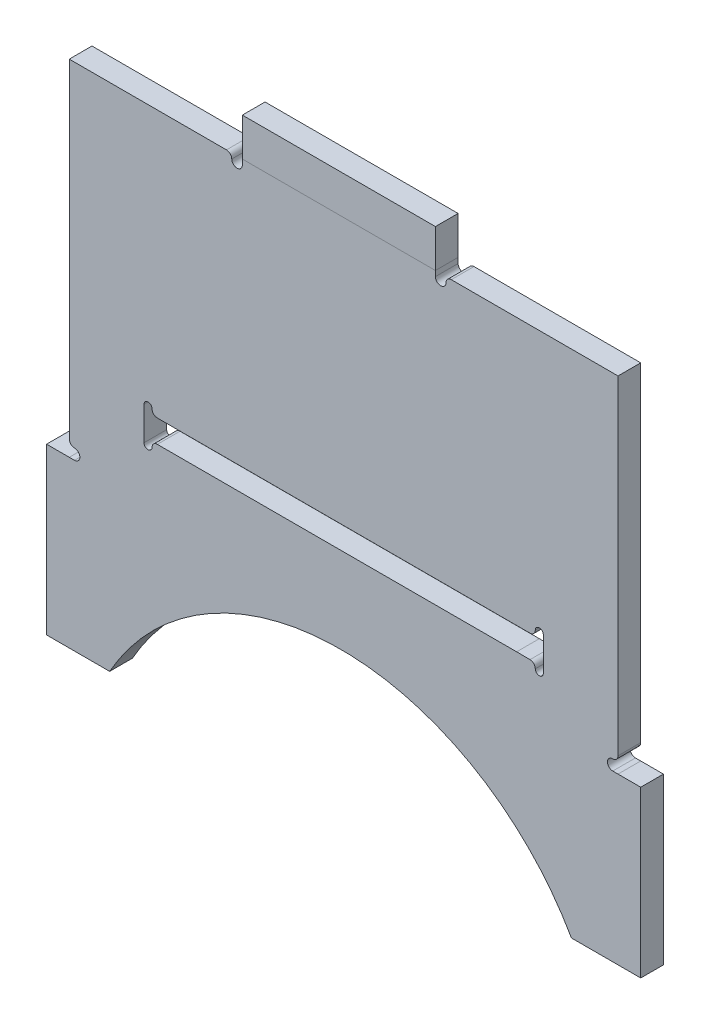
ISO-10303-21;
HEADER;
FILE_DESCRIPTION(('STEP AP214'),'2;1');
FILE_NAME('part.step','',(''),(''),'','','');
FILE_SCHEMA(('AUTOMOTIVE_DESIGN { 1 0 10303 214 1 1 1 1 }'));
ENDSEC;
DATA;
#1=APPLICATION_CONTEXT('core data for automotive mechanical design processes');
#2=APPLICATION_PROTOCOL_DEFINITION('international standard','automotive_design',2000,#1);
#3=PRODUCT_CONTEXT('',#1,'mechanical');
#4=PRODUCT('Part','Part','',(#3));
#5=PRODUCT_RELATED_PRODUCT_CATEGORY('part','',(#4));
#6=PRODUCT_DEFINITION_FORMATION('','',#4);
#7=PRODUCT_DEFINITION_CONTEXT('part definition',#1,'design');
#8=PRODUCT_DEFINITION('design','',#6,#7);
#9=PRODUCT_DEFINITION_SHAPE('','',#8);
#10=(LENGTH_UNIT() NAMED_UNIT(*) SI_UNIT(.MILLI.,.METRE.));
#11=(NAMED_UNIT(*) PLANE_ANGLE_UNIT() SI_UNIT($,.RADIAN.));
#12=(NAMED_UNIT(*) SI_UNIT($,.STERADIAN.) SOLID_ANGLE_UNIT());
#13=UNCERTAINTY_MEASURE_WITH_UNIT(LENGTH_MEASURE(1.E-05),#10,'distance_accuracy_value','');
#14=(GEOMETRIC_REPRESENTATION_CONTEXT(3) GLOBAL_UNCERTAINTY_ASSIGNED_CONTEXT((#13)) GLOBAL_UNIT_ASSIGNED_CONTEXT((#10,
#11,#12)) REPRESENTATION_CONTEXT('',''));
#15=CARTESIAN_POINT('',(0.,0.,0.));
#16=DIRECTION('',(0.,0.,1.));
#17=DIRECTION('',(1.,0.,0.));
#18=AXIS2_PLACEMENT_3D('',#15,#16,#17);
#19=CARTESIAN_POINT('',(146.6,381.93,0.));
#20=DIRECTION('',(-1.,0.,0.));
#21=DIRECTION('',(0.,0.,1.));
#22=AXIS2_PLACEMENT_3D('',#19,#20,#21);
#23=PLANE('',#22);
#24=DIRECTION('',(0.,-1.,0.));
#25=VECTOR('',#24,1.);
#26=CARTESIAN_POINT('',(146.6,381.93,17.));
#27=LINE('',#26,#25);
#28=CARTESIAN_POINT('',(146.6,410.434779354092,17.));
#29=VERTEX_POINT('',#28);
#30=CARTESIAN_POINT('',(146.6,381.93,17.));
#31=VERTEX_POINT('',#30);
#32=EDGE_CURVE('E108',#29,#31,#27,.T.);
#33=ORIENTED_EDGE('',*,*,#32,.F.);
#34=DIRECTION('',(0.,0.,1.));
#35=VECTOR('',#34,1.);
#36=CARTESIAN_POINT('',(146.6,410.434779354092,0.));
#37=LINE('',#36,#35);
#38=CARTESIAN_POINT('',(146.6,410.434779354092,0.));
#39=VERTEX_POINT('',#38);
#40=EDGE_CURVE('E12',#39,#29,#37,.T.);
#41=ORIENTED_EDGE('',*,*,#40,.F.);
#42=DIRECTION('',(0.,-1.,0.));
#43=VECTOR('',#42,1.);
#44=CARTESIAN_POINT('',(146.6,381.93,0.));
#45=LINE('',#44,#43);
#46=CARTESIAN_POINT('',(146.6,381.93,0.));
#47=VERTEX_POINT('',#46);
#48=EDGE_CURVE('E102',#39,#47,#45,.T.);
#49=ORIENTED_EDGE('',*,*,#48,.T.);
#50=DIRECTION('',(0.,0.,1.));
#51=VECTOR('',#50,1.);
#52=CARTESIAN_POINT('',(146.6,381.93,0.));
#53=LINE('',#52,#51);
#54=EDGE_CURVE('E47',#47,#31,#53,.T.);
#55=ORIENTED_EDGE('',*,*,#54,.T.);
#56=EDGE_LOOP('',(#33,#41,#49,#55));
#57=FACE_BOUND('',#56,.T.);
#58=ADVANCED_FACE('F44',(#57),#23,.T.);
#59=CARTESIAN_POINT('',(146.6,410.434779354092,0.));
#60=DIRECTION('',(0.,1.,0.));
#61=DIRECTION('',(-1.,0.,0.));
#62=AXIS2_PLACEMENT_3D('',#59,#60,#61);
#63=PLANE('',#62);
#64=DIRECTION('',(-1.,0.,0.));
#65=VECTOR('',#64,1.);
#66=CARTESIAN_POINT('',(146.6,410.434779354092,17.));
#67=LINE('',#66,#65);
#68=CARTESIAN_POINT('',(291.16,410.434779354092,17.));
#69=VERTEX_POINT('',#68);
#70=EDGE_CURVE('E104',#69,#29,#67,.T.);
#71=ORIENTED_EDGE('',*,*,#70,.F.);
#72=DIRECTION('',(0.,0.,1.));
#73=VECTOR('',#72,1.);
#74=CARTESIAN_POINT('',(291.16,410.434779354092,0.));
#75=LINE('',#74,#73);
#76=CARTESIAN_POINT('',(291.16,410.434779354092,0.));
#77=VERTEX_POINT('',#76);
#78=EDGE_CURVE('E53',#77,#69,#75,.T.);
#79=ORIENTED_EDGE('',*,*,#78,.F.);
#80=DIRECTION('',(-1.,0.,0.));
#81=VECTOR('',#80,1.);
#82=CARTESIAN_POINT('',(146.6,410.434779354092,0.));
#83=LINE('',#82,#81);
#84=EDGE_CURVE('E99',#77,#39,#83,.T.);
#85=ORIENTED_EDGE('',*,*,#84,.T.);
#86=ORIENTED_EDGE('',*,*,#40,.T.);
#87=EDGE_LOOP('',(#71,#79,#85,#86));
#88=FACE_BOUND('',#87,.T.);
#89=ADVANCED_FACE('F118',(#88),#63,.T.);
#90=CARTESIAN_POINT('',(291.16,381.93,0.));
#91=DIRECTION('',(1.,0.,0.));
#92=DIRECTION('',(0.,0.,-1.));
#93=AXIS2_PLACEMENT_3D('',#90,#91,#92);
#94=PLANE('',#93);
#95=DIRECTION('',(0.,1.,0.));
#96=VECTOR('',#95,1.);
#97=CARTESIAN_POINT('',(291.16,381.93,17.));
#98=LINE('',#97,#96);
#99=CARTESIAN_POINT('',(291.16,381.93,17.));
#100=VERTEX_POINT('',#99);
#101=EDGE_CURVE('E94',#100,#69,#98,.T.);
#102=ORIENTED_EDGE('',*,*,#101,.F.);
#103=DIRECTION('',(0.,0.,1.));
#104=VECTOR('',#103,1.);
#105=CARTESIAN_POINT('',(291.16,381.93,0.));
#106=LINE('',#105,#104);
#107=CARTESIAN_POINT('',(291.16,381.93,0.));
#108=VERTEX_POINT('',#107);
#109=EDGE_CURVE('E89',#108,#100,#106,.T.);
#110=ORIENTED_EDGE('',*,*,#109,.F.);
#111=DIRECTION('',(0.,1.,0.));
#112=VECTOR('',#111,1.);
#113=CARTESIAN_POINT('',(291.16,381.93,0.));
#114=LINE('',#113,#112);
#115=EDGE_CURVE('E92',#108,#77,#114,.T.);
#116=ORIENTED_EDGE('',*,*,#115,.T.);
#117=ORIENTED_EDGE('',*,*,#78,.T.);
#118=EDGE_LOOP('',(#102,#110,#116,#117));
#119=FACE_BOUND('',#118,.T.);
#120=ADVANCED_FACE('F91',(#119),#94,.T.);
#121=CARTESIAN_POINT('',(146.6,381.93,0.));
#122=DIRECTION('',(0.,-1.,0.));
#123=DIRECTION('',(0.,0.,-1.));
#124=AXIS2_PLACEMENT_3D('',#121,#122,#123);
#125=PLANE('',#124);
#126=DIRECTION('',(1.,0.,0.));
#127=VECTOR('',#126,1.);
#128=CARTESIAN_POINT('',(146.6,381.93,17.));
#129=LINE('',#128,#127);
#130=EDGE_CURVE('E111',#31,#100,#129,.T.);
#131=ORIENTED_EDGE('',*,*,#130,.F.);
#132=ORIENTED_EDGE('',*,*,#54,.F.);
#133=DIRECTION('',(1.,0.,0.));
#134=VECTOR('',#133,1.);
#135=CARTESIAN_POINT('',(146.6,381.93,0.));
#136=LINE('',#135,#134);
#137=EDGE_CURVE('E98',#47,#108,#136,.T.);
#138=ORIENTED_EDGE('',*,*,#137,.T.);
#139=ORIENTED_EDGE('',*,*,#109,.T.);
#140=EDGE_LOOP('',(#131,#132,#138,#139));
#141=FACE_BOUND('',#140,.T.);
#142=ADVANCED_FACE('F101',(#141),#125,.T.);
#143=CARTESIAN_POINT('',(0.,0.,0.));
#144=DIRECTION('',(0.,0.,-1.));
#145=DIRECTION('',(-1.,0.,0.));
#146=AXIS2_PLACEMENT_3D('',#143,#144,#145);
#147=PLANE('',#146);
#148=ORIENTED_EDGE('',*,*,#48,.F.);
#149=ORIENTED_EDGE('',*,*,#84,.F.);
#150=ORIENTED_EDGE('',*,*,#115,.F.);
#151=ORIENTED_EDGE('',*,*,#137,.F.);
#152=EDGE_LOOP('',(#148,#149,#150,#151));
#153=FACE_BOUND('',#152,.T.);
#154=ADVANCED_FACE('F97',(#153),#147,.T.);
#155=CARTESIAN_POINT('',(0.,0.,17.));
#156=DIRECTION('',(0.,0.,-1.));
#157=DIRECTION('',(-1.,0.,0.));
#158=AXIS2_PLACEMENT_3D('',#155,#156,#157);
#159=PLANE('',#158);
#160=ORIENTED_EDGE('',*,*,#32,.T.);
#161=ORIENTED_EDGE('',*,*,#130,.T.);
#162=ORIENTED_EDGE('',*,*,#101,.T.);
#163=ORIENTED_EDGE('',*,*,#70,.T.);
#164=EDGE_LOOP('',(#160,#161,#162,#163));
#165=FACE_BOUND('',#164,.T.);
#166=ADVANCED_FACE('F117',(#165),#159,.F.);
#167=CLOSED_SHELL('',(#58,#89,#120,#142,#154,#166));
#168=MANIFOLD_SOLID_BREP('B2',#167);
#169=CARTESIAN_POINT('',(0.,381.93,17.));
#170=DIRECTION('',(0.,1.,0.));
#171=DIRECTION('',(0.,0.,1.));
#172=AXIS2_PLACEMENT_3D('',#169,#170,#171);
#173=PLANE('',#172);
#174=DIRECTION('',(1.,0.,0.));
#175=VECTOR('',#174,1.);
#176=CARTESIAN_POINT('',(0.,381.93,17.));
#177=LINE('',#176,#175);
#178=CARTESIAN_POINT('',(17.,381.93,17.));
#179=VERTEX_POINT('',#178);
#180=CARTESIAN_POINT('',(134.71561516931,381.929999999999,17.));
#181=VERTEX_POINT('',#180);
#182=EDGE_CURVE('E509',#179,#181,#177,.T.);
#183=ORIENTED_EDGE('',*,*,#182,.T.);
#184=DIRECTION('',(0.,0.,1.));
#185=VECTOR('',#184,1.);
#186=CARTESIAN_POINT('',(134.71561516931,381.929999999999,0.));
#187=LINE('',#186,#185);
#188=CARTESIAN_POINT('',(134.71561516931,381.929999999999,0.));
#189=VERTEX_POINT('',#188);
#190=EDGE_CURVE('E438',#189,#181,#187,.T.);
#191=ORIENTED_EDGE('',*,*,#190,.F.);
#192=DIRECTION('',(1.,0.,0.));
#193=VECTOR('',#192,1.);
#194=CARTESIAN_POINT('',(0.,381.93,0.));
#195=LINE('',#194,#193);
#196=CARTESIAN_POINT('',(17.,381.93,0.));
#197=VERTEX_POINT('',#196);
#198=EDGE_CURVE('E590',#197,#189,#195,.T.);
#199=ORIENTED_EDGE('',*,*,#198,.F.);
#200=DIRECTION('',(0.,0.,-1.));
#201=VECTOR('',#200,1.);
#202=CARTESIAN_POINT('',(17.,381.93,17.));
#203=LINE('',#202,#201);
#204=EDGE_CURVE('E649',#179,#197,#203,.T.);
#205=ORIENTED_EDGE('',*,*,#204,.F.);
#206=EDGE_LOOP('',(#183,#191,#199,#205));
#207=FACE_BOUND('',#206,.T.);
#208=ADVANCED_FACE('F167',(#207),#173,.T.);
#209=DIRECTION('',(0.,0.,1.));
#210=VECTOR('',#209,1.);
#211=CARTESIAN_POINT('',(146.6,381.93,0.));
#212=LINE('',#211,#210);
#213=CARTESIAN_POINT('',(146.6,381.93,0.));
#214=VERTEX_POINT('',#213);
#215=CARTESIAN_POINT('',(146.6,381.93,17.));
#216=VERTEX_POINT('',#215);
#217=EDGE_CURVE('E184',#214,#216,#212,.T.);
#218=ORIENTED_EDGE('',*,*,#217,.T.);
#219=CARTESIAN_POINT('',(291.16,381.93,17.));
#220=VERTEX_POINT('',#219);
#221=EDGE_CURVE('E513',#216,#220,#177,.T.);
#222=ORIENTED_EDGE('',*,*,#221,.T.);
#223=DIRECTION('',(0.,0.,1.));
#224=VECTOR('',#223,1.);
#225=CARTESIAN_POINT('',(291.16,381.93,0.));
#226=LINE('',#225,#224);
#227=CARTESIAN_POINT('',(291.16,381.93,0.));
#228=VERTEX_POINT('',#227);
#229=EDGE_CURVE('E460',#228,#220,#226,.T.);
#230=ORIENTED_EDGE('',*,*,#229,.F.);
#231=EDGE_CURVE('E593',#214,#228,#195,.T.);
#232=ORIENTED_EDGE('',*,*,#231,.F.);
#233=EDGE_LOOP('',(#218,#222,#230,#232));
#234=FACE_BOUND('',#233,.T.);
#235=ADVANCED_FACE('F748',(#234),#173,.T.);
#236=CARTESIAN_POINT('',(0.,0.,17.));
#237=DIRECTION('',(0.,0.,1.));
#238=DIRECTION('',(1.,0.,0.));
#239=AXIS2_PLACEMENT_3D('',#236,#237,#238);
#240=PLANE('',#239);
#241=CARTESIAN_POINT('',(134.71561516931,377.972947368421,17.));
#242=DIRECTION('',(0.,0.,-1.));
#243=DIRECTION('',(-1.,0.,0.));
#244=AXIS2_PLACEMENT_3D('',#241,#242,#243);
#245=CIRCLE('',#244,3.95705263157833);
#246=CARTESIAN_POINT('',(138.672667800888,377.972947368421,17.));
#247=VERTEX_POINT('',#246);
#248=EDGE_CURVE('E426',#181,#247,#245,.T.);
#249=ORIENTED_EDGE('',*,*,#248,.F.);
#250=ORIENTED_EDGE('',*,*,#182,.F.);
#251=DIRECTION('',(0.,1.,0.));
#252=VECTOR('',#251,1.);
#253=CARTESIAN_POINT('',(17.,0.,17.));
#254=LINE('',#253,#252);
#255=CARTESIAN_POINT('',(17.,135.61438483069,17.));
#256=VERTEX_POINT('',#255);
#257=EDGE_CURVE('E512',#256,#179,#254,.T.);
#258=ORIENTED_EDGE('',*,*,#257,.F.);
#259=CARTESIAN_POINT('',(20.9570526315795,135.61438483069,17.));
#260=DIRECTION('',(0.,0.,1.));
#261=DIRECTION('',(1.,0.,0.));
#262=AXIS2_PLACEMENT_3D('',#259,#260,#261);
#263=CIRCLE('',#262,3.95705263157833);
#264=CARTESIAN_POINT('',(20.957052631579,131.657332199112,17.));
#265=VERTEX_POINT('',#264);
#266=EDGE_CURVE('E516',#256,#265,#263,.T.);
#267=ORIENTED_EDGE('',*,*,#266,.T.);
#268=CARTESIAN_POINT('',(20.9570526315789,127.700279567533,17.));
#269=DIRECTION('',(0.,0.,1.));
#270=DIRECTION('',(1.,0.,0.));
#271=AXIS2_PLACEMENT_3D('',#268,#269,#270);
#272=CIRCLE('',#271,3.95705263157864);
#273=CARTESIAN_POINT('',(20.9570526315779,123.743226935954,17.));
#274=VERTEX_POINT('',#273);
#275=EDGE_CURVE('E518',#274,#265,#272,.T.);
#276=ORIENTED_EDGE('',*,*,#275,.F.);
#277=DIRECTION('',(-0.999994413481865,-0.00334260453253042,0.));
#278=VECTOR('',#277,1.);
#279=CARTESIAN_POINT('',(-0.413388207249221,123.671793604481,17.));
#280=LINE('',#279,#278);
#281=CARTESIAN_POINT('',(17.,123.73,17.));
#282=VERTEX_POINT('',#281);
#283=EDGE_CURVE('E521',#274,#282,#280,.T.);
#284=ORIENTED_EDGE('',*,*,#283,.T.);
#285=DIRECTION('',(1.,0.,0.));
#286=VECTOR('',#285,1.);
#287=CARTESIAN_POINT('',(0.,123.73,17.));
#288=LINE('',#287,#286);
#289=CARTESIAN_POINT('',(0.,123.73,17.));
#290=VERTEX_POINT('',#289);
#291=EDGE_CURVE('E523',#290,#282,#288,.T.);
#292=ORIENTED_EDGE('',*,*,#291,.F.);
#293=DIRECTION('',(0.,1.,0.));
#294=VECTOR('',#293,1.);
#295=CARTESIAN_POINT('',(0.,0.,17.));
#296=LINE('',#295,#294);
#297=CARTESIAN_POINT('',(0.,0.,17.));
#298=VERTEX_POINT('',#297);
#299=EDGE_CURVE('E526',#298,#290,#296,.T.);
#300=ORIENTED_EDGE('',*,*,#299,.F.);
#301=DIRECTION('',(1.,0.,0.));
#302=VECTOR('',#301,1.);
#303=CARTESIAN_POINT('',(0.,0.,17.));
#304=LINE('',#303,#302);
#305=CARTESIAN_POINT('',(47.240220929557,0.,17.));
#306=VERTEX_POINT('',#305);
#307=EDGE_CURVE('E529',#298,#306,#304,.T.);
#308=ORIENTED_EDGE('',*,*,#307,.T.);
#309=CARTESIAN_POINT('',(220.127273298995,-97.8115241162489,17.));
#310=DIRECTION('',(0.,0.,1.));
#311=DIRECTION('',(1.,0.,0.));
#312=AXIS2_PLACEMENT_3D('',#309,#310,#311);
#313=CIRCLE('',#312,198.637929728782);
#314=CARTESIAN_POINT('',(393.014325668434,0.,17.));
#315=VERTEX_POINT('',#314);
#316=EDGE_CURVE('E532',#306,#315,#313,.F.);
#317=ORIENTED_EDGE('',*,*,#316,.T.);
#318=CARTESIAN_POINT('',(444.91,0.,17.));
#319=VERTEX_POINT('',#318);
#320=EDGE_CURVE('E533',#315,#319,#304,.T.);
#321=ORIENTED_EDGE('',*,*,#320,.T.);
#322=DIRECTION('',(0.,1.,0.));
#323=VECTOR('',#322,1.);
#324=CARTESIAN_POINT('',(444.91,0.,17.));
#325=LINE('',#324,#323);
#326=CARTESIAN_POINT('',(444.91,123.73,17.));
#327=VERTEX_POINT('',#326);
#328=EDGE_CURVE('E536',#319,#327,#325,.T.);
#329=ORIENTED_EDGE('',*,*,#328,.T.);
#330=DIRECTION('',(-1.,0.,0.));
#331=VECTOR('',#330,1.);
#332=CARTESIAN_POINT('',(0.,123.73,17.));
#333=LINE('',#332,#331);
#334=CARTESIAN_POINT('',(427.91,123.73,17.));
#335=VERTEX_POINT('',#334);
#336=EDGE_CURVE('E539',#327,#335,#333,.T.);
#337=ORIENTED_EDGE('',*,*,#336,.T.);
#338=DIRECTION('',(0.999994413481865,-0.00334260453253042,0.));
#339=VECTOR('',#338,1.);
#340=CARTESIAN_POINT('',(0.418359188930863,125.158943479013,17.));
#341=LINE('',#340,#339);
#342=CARTESIAN_POINT('',(423.952947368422,123.743226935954,17.));
#343=VERTEX_POINT('',#342);
#344=EDGE_CURVE('E497',#343,#335,#341,.T.);
#345=ORIENTED_EDGE('',*,*,#344,.F.);
#346=CARTESIAN_POINT('',(423.952947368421,127.700279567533,17.));
#347=DIRECTION('',(0.,0.,1.));
#348=DIRECTION('',(1.,0.,0.));
#349=AXIS2_PLACEMENT_3D('',#346,#347,#348);
#350=CIRCLE('',#349,3.95705263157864);
#351=CARTESIAN_POINT('',(423.952947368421,131.657332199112,17.));
#352=VERTEX_POINT('',#351);
#353=EDGE_CURVE('E500',#343,#352,#350,.F.);
#354=ORIENTED_EDGE('',*,*,#353,.T.);
#355=CARTESIAN_POINT('',(423.952947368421,135.61438483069,17.));
#356=DIRECTION('',(0.,0.,1.));
#357=DIRECTION('',(1.,0.,0.));
#358=AXIS2_PLACEMENT_3D('',#355,#356,#357);
#359=CIRCLE('',#358,3.95705263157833);
#360=CARTESIAN_POINT('',(427.91,135.61438483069,17.));
#361=VERTEX_POINT('',#360);
#362=EDGE_CURVE('E502',#361,#352,#359,.F.);
#363=ORIENTED_EDGE('',*,*,#362,.F.);
#364=DIRECTION('',(0.,1.,0.));
#365=VECTOR('',#364,1.);
#366=CARTESIAN_POINT('',(427.91,0.,17.));
#367=LINE('',#366,#365);
#368=CARTESIAN_POINT('',(427.91,381.93,17.));
#369=VERTEX_POINT('',#368);
#370=EDGE_CURVE('E505',#361,#369,#367,.T.);
#371=ORIENTED_EDGE('',*,*,#370,.T.);
#372=CARTESIAN_POINT('',(303.04438483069,381.929999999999,17.));
#373=VERTEX_POINT('',#372);
#374=EDGE_CURVE('E508',#373,#369,#177,.T.);
#375=ORIENTED_EDGE('',*,*,#374,.F.);
#376=CARTESIAN_POINT('',(303.04438483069,377.972947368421,17.));
#377=DIRECTION('',(0.,0.,-1.));
#378=DIRECTION('',(1.,0.,0.));
#379=AXIS2_PLACEMENT_3D('',#376,#377,#378);
#380=CIRCLE('',#379,3.95705263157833);
#381=CARTESIAN_POINT('',(299.087332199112,377.972947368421,17.));
#382=VERTEX_POINT('',#381);
#383=EDGE_CURVE('E453',#382,#373,#380,.T.);
#384=ORIENTED_EDGE('',*,*,#383,.F.);
#385=CARTESIAN_POINT('',(295.130279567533,377.972947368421,17.));
#386=DIRECTION('',(0.,0.,1.));
#387=DIRECTION('',(1.,0.,0.));
#388=AXIS2_PLACEMENT_3D('',#385,#386,#387);
#389=CIRCLE('',#388,3.95705263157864);
#390=CARTESIAN_POINT('',(291.173226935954,377.972947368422,17.));
#391=VERTEX_POINT('',#390);
#392=EDGE_CURVE('E437',#391,#382,#389,.T.);
#393=ORIENTED_EDGE('',*,*,#392,.F.);
#394=DIRECTION('',(0.00334260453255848,-0.999994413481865,0.));
#395=VECTOR('',#394,1.);
#396=CARTESIAN_POINT('',(291.173226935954,377.972947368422,17.));
#397=LINE('',#396,#395);
#398=EDGE_CURVE('E445',#220,#391,#397,.T.);
#399=ORIENTED_EDGE('',*,*,#398,.F.);
#400=ORIENTED_EDGE('',*,*,#221,.F.);
#401=DIRECTION('',(0.00334260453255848,0.999994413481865,0.));
#402=VECTOR('',#401,1.);
#403=CARTESIAN_POINT('',(146.586773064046,377.972947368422,17.));
#404=LINE('',#403,#402);
#405=CARTESIAN_POINT('',(146.586773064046,377.972947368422,17.));
#406=VERTEX_POINT('',#405);
#407=EDGE_CURVE('E429',#406,#216,#404,.T.);
#408=ORIENTED_EDGE('',*,*,#407,.F.);
#409=CARTESIAN_POINT('',(142.629720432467,377.972947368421,17.));
#410=DIRECTION('',(0.,0.,1.));
#411=DIRECTION('',(-1.,0.,0.));
#412=AXIS2_PLACEMENT_3D('',#409,#410,#411);
#413=CIRCLE('',#412,3.95705263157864);
#414=EDGE_CURVE('E415',#247,#406,#413,.T.);
#415=ORIENTED_EDGE('',*,*,#414,.F.);
#416=EDGE_LOOP('',(#249,#250,#258,#267,#276,#284,#292,#300,#308,#317,#321,#329,#337,#345,#354,
#363,#371,#375,#384,#393,#399,#400,#408,#415));
#417=FACE_BOUND('',#416,.T.);
#418=CARTESIAN_POINT('',(368.945246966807,161.033052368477,17.));
#419=DIRECTION('',(0.,0.,1.));
#420=DIRECTION('',(1.,0.,0.));
#421=AXIS2_PLACEMENT_3D('',#418,#419,#420);
#422=CIRCLE('',#421,3.);
#423=CARTESIAN_POINT('',(365.945246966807,161.033052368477,17.));
#424=VERTEX_POINT('',#423);
#425=CARTESIAN_POINT('',(371.945246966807,161.033052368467,17.));
#426=VERTEX_POINT('',#425);
#427=EDGE_CURVE('E465',#424,#426,#422,.T.);
#428=ORIENTED_EDGE('',*,*,#427,.F.);
#429=CARTESIAN_POINT('',(361.98819433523,161.033052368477,17.));
#430=DIRECTION('',(0.,0.,1.));
#431=DIRECTION('',(1.,0.,0.));
#432=AXIS2_PLACEMENT_3D('',#429,#430,#431);
#433=CIRCLE('',#432,3.95705263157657);
#434=CARTESIAN_POINT('',(361.98778540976,164.990104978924,17.));
#435=VERTEX_POINT('',#434);
#436=EDGE_CURVE('E468',#424,#435,#433,.T.);
#437=ORIENTED_EDGE('',*,*,#436,.T.);
#438=DIRECTION('',(-0.999959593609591,0.00898950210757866,0.));
#439=VECTOR('',#438,1.);
#440=CARTESIAN_POINT('',(1.51237161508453,168.230730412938,17.));
#441=LINE('',#440,#439);
#442=CARTESIAN_POINT('',(351.988189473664,165.08,17.));
#443=VERTEX_POINT('',#442);
#444=EDGE_CURVE('E471',#435,#443,#441,.T.);
#445=ORIENTED_EDGE('',*,*,#444,.T.);
#446=DIRECTION('',(1.,0.,0.));
#447=VECTOR('',#446,1.);
#448=CARTESIAN_POINT('',(0.,165.08,17.));
#449=LINE('',#448,#447);
#450=CARTESIAN_POINT('',(82.9170526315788,165.080000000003,17.));
#451=VERTEX_POINT('',#450);
#452=EDGE_CURVE('E473',#451,#443,#449,.T.);
#453=ORIENTED_EDGE('',*,*,#452,.F.);
#454=CARTESIAN_POINT('',(82.9170526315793,161.122947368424,17.));
#455=DIRECTION('',(0.,0.,1.));
#456=DIRECTION('',(1.,0.,0.));
#457=AXIS2_PLACEMENT_3D('',#454,#455,#456);
#458=CIRCLE('',#457,3.95705263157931);
#459=CARTESIAN_POINT('',(78.96,161.122947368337,17.));
#460=VERTEX_POINT('',#459);
#461=EDGE_CURVE('E476',#451,#460,#458,.T.);
#462=ORIENTED_EDGE('',*,*,#461,.T.);
#463=CARTESIAN_POINT('',(75.96,161.122947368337,17.));
#464=DIRECTION('',(0.,0.,1.));
#465=DIRECTION('',(1.,0.,0.));
#466=AXIS2_PLACEMENT_3D('',#463,#464,#465);
#467=CIRCLE('',#466,3.);
#468=CARTESIAN_POINT('',(72.96,161.122947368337,17.));
#469=VERTEX_POINT('',#468);
#470=EDGE_CURVE('E478',#469,#460,#467,.T.);
#471=ORIENTED_EDGE('',*,*,#470,.F.);
#472=DIRECTION('',(0.,1.,0.));
#473=VECTOR('',#472,1.);
#474=CARTESIAN_POINT('',(72.96,0.,17.));
#475=LINE('',#474,#473);
#476=CARTESIAN_POINT('',(72.96,186.122947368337,17.));
#477=VERTEX_POINT('',#476);
#478=EDGE_CURVE('E481',#469,#477,#475,.T.);
#479=ORIENTED_EDGE('',*,*,#478,.T.);
#480=CARTESIAN_POINT('',(75.96,186.122947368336,17.));
#481=DIRECTION('',(0.,0.,1.));
#482=DIRECTION('',(1.,0.,0.));
#483=AXIS2_PLACEMENT_3D('',#480,#481,#482);
#484=CIRCLE('',#483,3.);
#485=CARTESIAN_POINT('',(78.96,186.122947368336,17.));
#486=VERTEX_POINT('',#485);
#487=EDGE_CURVE('E483',#486,#477,#484,.T.);
#488=ORIENTED_EDGE('',*,*,#487,.F.);
#489=CARTESIAN_POINT('',(82.9170526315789,186.122947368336,17.));
#490=DIRECTION('',(0.,0.,1.));
#491=DIRECTION('',(1.,0.,0.));
#492=AXIS2_PLACEMENT_3D('',#489,#490,#491);
#493=CIRCLE('',#492,3.95705263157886);
#494=CARTESIAN_POINT('',(82.9170526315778,182.165894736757,17.));
#495=VERTEX_POINT('',#494);
#496=EDGE_CURVE('E486',#486,#495,#493,.T.);
#497=ORIENTED_EDGE('',*,*,#496,.T.);
#498=DIRECTION('',(1.,0.,0.));
#499=VECTOR('',#498,1.);
#500=CARTESIAN_POINT('',(0.,182.165894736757,17.));
#501=LINE('',#500,#499);
#502=CARTESIAN_POINT('',(361.98818947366,182.165894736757,17.));
#503=VERTEX_POINT('',#502);
#504=EDGE_CURVE('E488',#495,#503,#501,.T.);
#505=ORIENTED_EDGE('',*,*,#504,.T.);
#506=CARTESIAN_POINT('',(361.988189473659,186.122947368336,17.));
#507=DIRECTION('',(0.,0.,1.));
#508=DIRECTION('',(1.,0.,0.));
#509=AXIS2_PLACEMENT_3D('',#506,#507,#508);
#510=CIRCLE('',#509,3.95705263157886);
#511=CARTESIAN_POINT('',(365.945242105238,186.122947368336,17.));
#512=VERTEX_POINT('',#511);
#513=EDGE_CURVE('E490',#503,#512,#510,.T.);
#514=ORIENTED_EDGE('',*,*,#513,.T.);
#515=CARTESIAN_POINT('',(368.945242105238,186.122947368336,17.));
#516=DIRECTION('',(0.,0.,1.));
#517=DIRECTION('',(1.,0.,0.));
#518=AXIS2_PLACEMENT_3D('',#515,#516,#517);
#519=CIRCLE('',#518,3.);
#520=CARTESIAN_POINT('',(371.943894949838,186.033052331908,17.));
#521=VERTEX_POINT('',#520);
#522=EDGE_CURVE('E492',#521,#512,#519,.T.);
#523=ORIENTED_EDGE('',*,*,#522,.F.);
#524=DIRECTION('',(5.40806787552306E-05,-0.99999999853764,0.));
#525=VECTOR('',#524,1.);
#526=CARTESIAN_POINT('',(371.953954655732,0.0201155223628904,17.));
#527=LINE('',#526,#525);
#528=EDGE_CURVE('E495',#521,#426,#527,.T.);
#529=ORIENTED_EDGE('',*,*,#528,.T.);
#530=EDGE_LOOP('',(#428,#437,#445,#453,#462,#471,#479,#488,#497,#505,#514,#523,#529));
#531=FACE_BOUND('',#530,.T.);
#532=ADVANCED_FACE('F755',(#417,#531),#240,.T.);
#533=CARTESIAN_POINT('',(0.,0.,0.));
#534=DIRECTION('',(0.,0.,1.));
#535=DIRECTION('',(1.,0.,0.));
#536=AXIS2_PLACEMENT_3D('',#533,#534,#535);
#537=PLANE('',#536);
#538=CARTESIAN_POINT('',(368.945246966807,161.033052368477,0.));
#539=DIRECTION('',(0.,0.,1.));
#540=DIRECTION('',(1.,0.,0.));
#541=AXIS2_PLACEMENT_3D('',#538,#539,#540);
#542=CIRCLE('',#541,3.);
#543=CARTESIAN_POINT('',(365.945246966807,161.033052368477,0.));
#544=VERTEX_POINT('',#543);
#545=CARTESIAN_POINT('',(371.945246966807,161.033052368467,0.));
#546=VERTEX_POINT('',#545);
#547=EDGE_CURVE('E459',#544,#546,#542,.T.);
#548=ORIENTED_EDGE('',*,*,#547,.T.);
#549=DIRECTION('',(5.40806787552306E-05,-0.99999999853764,0.));
#550=VECTOR('',#549,1.);
#551=CARTESIAN_POINT('',(371.953954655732,0.0201155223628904,0.));
#552=LINE('',#551,#550);
#553=CARTESIAN_POINT('',(371.943894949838,186.033052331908,0.));
#554=VERTEX_POINT('',#553);
#555=EDGE_CURVE('E574',#554,#546,#552,.T.);
#556=ORIENTED_EDGE('',*,*,#555,.F.);
#557=CARTESIAN_POINT('',(368.945242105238,186.122947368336,0.));
#558=DIRECTION('',(0.,0.,1.));
#559=DIRECTION('',(1.,0.,0.));
#560=AXIS2_PLACEMENT_3D('',#557,#558,#559);
#561=CIRCLE('',#560,3.);
#562=CARTESIAN_POINT('',(365.945242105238,186.122947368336,0.));
#563=VERTEX_POINT('',#562);
#564=EDGE_CURVE('E571',#554,#563,#561,.T.);
#565=ORIENTED_EDGE('',*,*,#564,.T.);
#566=CARTESIAN_POINT('',(361.988189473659,186.122947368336,0.));
#567=DIRECTION('',(0.,0.,1.));
#568=DIRECTION('',(1.,0.,0.));
#569=AXIS2_PLACEMENT_3D('',#566,#567,#568);
#570=CIRCLE('',#569,3.95705263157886);
#571=CARTESIAN_POINT('',(361.98818947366,182.165894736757,0.));
#572=VERTEX_POINT('',#571);
#573=EDGE_CURVE('E568',#572,#563,#570,.T.);
#574=ORIENTED_EDGE('',*,*,#573,.F.);
#575=DIRECTION('',(1.,0.,0.));
#576=VECTOR('',#575,1.);
#577=CARTESIAN_POINT('',(0.,182.165894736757,0.));
#578=LINE('',#577,#576);
#579=CARTESIAN_POINT('',(82.9170526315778,182.165894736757,0.));
#580=VERTEX_POINT('',#579);
#581=EDGE_CURVE('E566',#580,#572,#578,.T.);
#582=ORIENTED_EDGE('',*,*,#581,.F.);
#583=CARTESIAN_POINT('',(82.9170526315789,186.122947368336,0.));
#584=DIRECTION('',(0.,0.,1.));
#585=DIRECTION('',(1.,0.,0.));
#586=AXIS2_PLACEMENT_3D('',#583,#584,#585);
#587=CIRCLE('',#586,3.95705263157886);
#588=CARTESIAN_POINT('',(78.96,186.122947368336,0.));
#589=VERTEX_POINT('',#588);
#590=EDGE_CURVE('E564',#589,#580,#587,.T.);
#591=ORIENTED_EDGE('',*,*,#590,.F.);
#592=CARTESIAN_POINT('',(75.96,186.122947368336,0.));
#593=DIRECTION('',(0.,0.,1.));
#594=DIRECTION('',(1.,0.,0.));
#595=AXIS2_PLACEMENT_3D('',#592,#593,#594);
#596=CIRCLE('',#595,3.);
#597=CARTESIAN_POINT('',(72.96,186.122947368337,0.));
#598=VERTEX_POINT('',#597);
#599=EDGE_CURVE('E561',#589,#598,#596,.T.);
#600=ORIENTED_EDGE('',*,*,#599,.T.);
#601=DIRECTION('',(0.,1.,0.));
#602=VECTOR('',#601,1.);
#603=CARTESIAN_POINT('',(72.96,0.,0.));
#604=LINE('',#603,#602);
#605=CARTESIAN_POINT('',(72.96,161.122947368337,0.));
#606=VERTEX_POINT('',#605);
#607=EDGE_CURVE('E558',#606,#598,#604,.T.);
#608=ORIENTED_EDGE('',*,*,#607,.F.);
#609=CARTESIAN_POINT('',(75.96,161.122947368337,0.));
#610=DIRECTION('',(0.,0.,1.));
#611=DIRECTION('',(1.,0.,0.));
#612=AXIS2_PLACEMENT_3D('',#609,#610,#611);
#613=CIRCLE('',#612,3.);
#614=CARTESIAN_POINT('',(78.96,161.122947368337,0.));
#615=VERTEX_POINT('',#614);
#616=EDGE_CURVE('E555',#606,#615,#613,.T.);
#617=ORIENTED_EDGE('',*,*,#616,.T.);
#618=CARTESIAN_POINT('',(82.9170526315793,161.122947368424,0.));
#619=DIRECTION('',(0.,0.,1.));
#620=DIRECTION('',(1.,0.,0.));
#621=AXIS2_PLACEMENT_3D('',#618,#619,#620);
#622=CIRCLE('',#621,3.95705263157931);
#623=CARTESIAN_POINT('',(82.9170526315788,165.080000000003,0.));
#624=VERTEX_POINT('',#623);
#625=EDGE_CURVE('E552',#624,#615,#622,.T.);
#626=ORIENTED_EDGE('',*,*,#625,.F.);
#627=DIRECTION('',(1.,0.,0.));
#628=VECTOR('',#627,1.);
#629=CARTESIAN_POINT('',(0.,165.08,0.));
#630=LINE('',#629,#628);
#631=CARTESIAN_POINT('',(351.988189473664,165.08,0.));
#632=VERTEX_POINT('',#631);
#633=EDGE_CURVE('E549',#624,#632,#630,.T.);
#634=ORIENTED_EDGE('',*,*,#633,.T.);
#635=DIRECTION('',(-0.999959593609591,0.00898950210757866,0.));
#636=VECTOR('',#635,1.);
#637=CARTESIAN_POINT('',(1.51237161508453,168.230730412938,0.));
#638=LINE('',#637,#636);
#639=CARTESIAN_POINT('',(361.98778540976,164.990104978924,0.));
#640=VERTEX_POINT('',#639);
#641=EDGE_CURVE('E546',#640,#632,#638,.T.);
#642=ORIENTED_EDGE('',*,*,#641,.F.);
#643=CARTESIAN_POINT('',(361.98819433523,161.033052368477,0.));
#644=DIRECTION('',(0.,0.,1.));
#645=DIRECTION('',(1.,0.,0.));
#646=AXIS2_PLACEMENT_3D('',#643,#644,#645);
#647=CIRCLE('',#646,3.95705263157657);
#648=EDGE_CURVE('E544',#544,#640,#647,.T.);
#649=ORIENTED_EDGE('',*,*,#648,.F.);
#650=EDGE_LOOP('',(#548,#556,#565,#574,#582,#591,#600,#608,#617,#626,#634,#642,#649));
#651=FACE_BOUND('',#650,.T.);
#652=ORIENTED_EDGE('',*,*,#198,.T.);
#653=CARTESIAN_POINT('',(134.71561516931,377.972947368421,0.));
#654=DIRECTION('',(0.,0.,-1.));
#655=DIRECTION('',(-1.,0.,0.));
#656=AXIS2_PLACEMENT_3D('',#653,#654,#655);
#657=CIRCLE('',#656,3.95705263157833);
#658=CARTESIAN_POINT('',(138.672667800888,377.972947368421,0.));
#659=VERTEX_POINT('',#658);
#660=EDGE_CURVE('E417',#189,#659,#657,.T.);
#661=ORIENTED_EDGE('',*,*,#660,.T.);
#662=CARTESIAN_POINT('',(142.629720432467,377.972947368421,0.));
#663=DIRECTION('',(0.,0.,1.));
#664=DIRECTION('',(-1.,0.,0.));
#665=AXIS2_PLACEMENT_3D('',#662,#663,#664);
#666=CIRCLE('',#665,3.95705263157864);
#667=CARTESIAN_POINT('',(146.586773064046,377.972947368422,0.));
#668=VERTEX_POINT('',#667);
#669=EDGE_CURVE('E412',#659,#668,#666,.T.);
#670=ORIENTED_EDGE('',*,*,#669,.T.);
#671=DIRECTION('',(0.00334260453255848,0.999994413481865,0.));
#672=VECTOR('',#671,1.);
#673=CARTESIAN_POINT('',(146.586773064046,377.972947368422,0.));
#674=LINE('',#673,#672);
#675=EDGE_CURVE('E419',#668,#214,#674,.T.);
#676=ORIENTED_EDGE('',*,*,#675,.T.);
#677=ORIENTED_EDGE('',*,*,#231,.T.);
#678=DIRECTION('',(0.00334260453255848,-0.999994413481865,0.));
#679=VECTOR('',#678,1.);
#680=CARTESIAN_POINT('',(291.173226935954,377.972947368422,0.));
#681=LINE('',#680,#679);
#682=CARTESIAN_POINT('',(291.173226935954,377.972947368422,0.));
#683=VERTEX_POINT('',#682);
#684=EDGE_CURVE('E447',#228,#683,#681,.T.);
#685=ORIENTED_EDGE('',*,*,#684,.T.);
#686=CARTESIAN_POINT('',(295.130279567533,377.972947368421,0.));
#687=DIRECTION('',(0.,0.,1.));
#688=DIRECTION('',(1.,0.,0.));
#689=AXIS2_PLACEMENT_3D('',#686,#687,#688);
#690=CIRCLE('',#689,3.95705263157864);
#691=CARTESIAN_POINT('',(299.087332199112,377.972947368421,0.));
#692=VERTEX_POINT('',#691);
#693=EDGE_CURVE('E441',#683,#692,#690,.T.);
#694=ORIENTED_EDGE('',*,*,#693,.T.);
#695=CARTESIAN_POINT('',(303.04438483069,377.972947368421,0.));
#696=DIRECTION('',(0.,0.,-1.));
#697=DIRECTION('',(1.,0.,0.));
#698=AXIS2_PLACEMENT_3D('',#695,#696,#697);
#699=CIRCLE('',#698,3.95705263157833);
#700=CARTESIAN_POINT('',(303.04438483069,381.93,0.));
#701=VERTEX_POINT('',#700);
#702=EDGE_CURVE('E444',#692,#701,#699,.T.);
#703=ORIENTED_EDGE('',*,*,#702,.T.);
#704=CARTESIAN_POINT('',(427.91,381.93,0.));
#705=VERTEX_POINT('',#704);
#706=EDGE_CURVE('E589',#701,#705,#195,.T.);
#707=ORIENTED_EDGE('',*,*,#706,.T.);
#708=DIRECTION('',(0.,1.,0.));
#709=VECTOR('',#708,1.);
#710=CARTESIAN_POINT('',(427.91,0.,0.));
#711=LINE('',#710,#709);
#712=CARTESIAN_POINT('',(427.91,135.61438483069,0.));
#713=VERTEX_POINT('',#712);
#714=EDGE_CURVE('E586',#713,#705,#711,.T.);
#715=ORIENTED_EDGE('',*,*,#714,.F.);
#716=CARTESIAN_POINT('',(423.952947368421,135.61438483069,0.));
#717=DIRECTION('',(0.,0.,1.));
#718=DIRECTION('',(1.,0.,0.));
#719=AXIS2_PLACEMENT_3D('',#716,#717,#718);
#720=CIRCLE('',#719,3.95705263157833);
#721=CARTESIAN_POINT('',(423.952947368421,131.657332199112,0.));
#722=VERTEX_POINT('',#721);
#723=EDGE_CURVE('E583',#713,#722,#720,.F.);
#724=ORIENTED_EDGE('',*,*,#723,.T.);
#725=CARTESIAN_POINT('',(423.952947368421,127.700279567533,0.));
#726=DIRECTION('',(0.,0.,1.));
#727=DIRECTION('',(1.,0.,0.));
#728=AXIS2_PLACEMENT_3D('',#725,#726,#727);
#729=CIRCLE('',#728,3.95705263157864);
#730=CARTESIAN_POINT('',(423.952947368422,123.743226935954,0.));
#731=VERTEX_POINT('',#730);
#732=EDGE_CURVE('E580',#731,#722,#729,.F.);
#733=ORIENTED_EDGE('',*,*,#732,.F.);
#734=DIRECTION('',(0.999994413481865,-0.00334260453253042,0.));
#735=VECTOR('',#734,1.);
#736=CARTESIAN_POINT('',(0.418359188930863,125.158943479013,0.));
#737=LINE('',#736,#735);
#738=CARTESIAN_POINT('',(427.91,123.73,0.));
#739=VERTEX_POINT('',#738);
#740=EDGE_CURVE('E577',#731,#739,#737,.T.);
#741=ORIENTED_EDGE('',*,*,#740,.T.);
#742=DIRECTION('',(-1.,0.,0.));
#743=VECTOR('',#742,1.);
#744=CARTESIAN_POINT('',(0.,123.73,0.));
#745=LINE('',#744,#743);
#746=CARTESIAN_POINT('',(444.91,123.73,0.));
#747=VERTEX_POINT('',#746);
#748=EDGE_CURVE('E469',#747,#739,#745,.T.);
#749=ORIENTED_EDGE('',*,*,#748,.F.);
#750=DIRECTION('',(0.,1.,0.));
#751=VECTOR('',#750,1.);
#752=CARTESIAN_POINT('',(444.91,0.,0.));
#753=LINE('',#752,#751);
#754=CARTESIAN_POINT('',(444.91,0.,0.));
#755=VERTEX_POINT('',#754);
#756=EDGE_CURVE('E618',#755,#747,#753,.T.);
#757=ORIENTED_EDGE('',*,*,#756,.F.);
#758=DIRECTION('',(1.,0.,0.));
#759=VECTOR('',#758,1.);
#760=CARTESIAN_POINT('',(0.,0.,0.));
#761=LINE('',#760,#759);
#762=CARTESIAN_POINT('',(393.014325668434,0.,0.));
#763=VERTEX_POINT('',#762);
#764=EDGE_CURVE('E615',#763,#755,#761,.T.);
#765=ORIENTED_EDGE('',*,*,#764,.F.);
#766=CARTESIAN_POINT('',(220.127273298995,-97.8115241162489,0.));
#767=DIRECTION('',(0.,0.,1.));
#768=DIRECTION('',(1.,0.,0.));
#769=AXIS2_PLACEMENT_3D('',#766,#767,#768);
#770=CIRCLE('',#769,198.637929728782);
#771=CARTESIAN_POINT('',(47.240220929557,0.,0.));
#772=VERTEX_POINT('',#771);
#773=EDGE_CURVE('E614',#772,#763,#770,.F.);
#774=ORIENTED_EDGE('',*,*,#773,.F.);
#775=CARTESIAN_POINT('',(0.,0.,0.));
#776=VERTEX_POINT('',#775);
#777=EDGE_CURVE('E611',#776,#772,#761,.T.);
#778=ORIENTED_EDGE('',*,*,#777,.F.);
#779=DIRECTION('',(0.,1.,0.));
#780=VECTOR('',#779,1.);
#781=CARTESIAN_POINT('',(0.,0.,0.));
#782=LINE('',#781,#780);
#783=CARTESIAN_POINT('',(0.,123.73,0.));
#784=VERTEX_POINT('',#783);
#785=EDGE_CURVE('E608',#776,#784,#782,.T.);
#786=ORIENTED_EDGE('',*,*,#785,.T.);
#787=DIRECTION('',(1.,0.,0.));
#788=VECTOR('',#787,1.);
#789=CARTESIAN_POINT('',(0.,123.73,0.));
#790=LINE('',#789,#788);
#791=CARTESIAN_POINT('',(17.,123.73,0.));
#792=VERTEX_POINT('',#791);
#793=EDGE_CURVE('E605',#784,#792,#790,.T.);
#794=ORIENTED_EDGE('',*,*,#793,.T.);
#795=DIRECTION('',(-0.999994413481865,-0.00334260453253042,0.));
#796=VECTOR('',#795,1.);
#797=CARTESIAN_POINT('',(-0.413388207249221,123.671793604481,0.));
#798=LINE('',#797,#796);
#799=CARTESIAN_POINT('',(20.9570526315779,123.743226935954,0.));
#800=VERTEX_POINT('',#799);
#801=EDGE_CURVE('E602',#800,#792,#798,.T.);
#802=ORIENTED_EDGE('',*,*,#801,.F.);
#803=CARTESIAN_POINT('',(20.9570526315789,127.700279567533,0.));
#804=DIRECTION('',(0.,0.,1.));
#805=DIRECTION('',(1.,0.,0.));
#806=AXIS2_PLACEMENT_3D('',#803,#804,#805);
#807=CIRCLE('',#806,3.95705263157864);
#808=CARTESIAN_POINT('',(20.957052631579,131.657332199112,0.));
#809=VERTEX_POINT('',#808);
#810=EDGE_CURVE('E599',#800,#809,#807,.T.);
#811=ORIENTED_EDGE('',*,*,#810,.T.);
#812=CARTESIAN_POINT('',(20.9570526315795,135.61438483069,0.));
#813=DIRECTION('',(0.,0.,1.));
#814=DIRECTION('',(1.,0.,0.));
#815=AXIS2_PLACEMENT_3D('',#812,#813,#814);
#816=CIRCLE('',#815,3.95705263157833);
#817=CARTESIAN_POINT('',(17.,135.61438483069,0.));
#818=VERTEX_POINT('',#817);
#819=EDGE_CURVE('E596',#818,#809,#816,.T.);
#820=ORIENTED_EDGE('',*,*,#819,.F.);
#821=DIRECTION('',(0.,1.,0.));
#822=VECTOR('',#821,1.);
#823=CARTESIAN_POINT('',(17.,0.,0.));
#824=LINE('',#823,#822);
#825=EDGE_CURVE('E592',#818,#197,#824,.T.);
#826=ORIENTED_EDGE('',*,*,#825,.T.);
#827=EDGE_LOOP('',(#652,#661,#670,#676,#677,#685,#694,#703,#707,#715,#724,#733,#741,#749,#757,
#765,#774,#778,#786,#794,#802,#811,#820,#826));
#828=FACE_BOUND('',#827,.T.);
#829=ADVANCED_FACE('F425',(#651,#828),#537,.F.);
#830=CARTESIAN_POINT('',(0.418359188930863,125.158943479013,17.));
#831=DIRECTION('',(0.00334260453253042,0.999994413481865,0.));
#832=DIRECTION('',(-0.999994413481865,0.00334260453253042,0.));
#833=AXIS2_PLACEMENT_3D('',#830,#831,#832);
#834=PLANE('',#833);
#835=ORIENTED_EDGE('',*,*,#740,.F.);
#836=DIRECTION('',(0.,0.,-1.));
#837=VECTOR('',#836,1.);
#838=CARTESIAN_POINT('',(423.952947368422,123.743226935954,17.));
#839=LINE('',#838,#837);
#840=EDGE_CURVE('E42',#343,#731,#839,.T.);
#841=ORIENTED_EDGE('',*,*,#840,.F.);
#842=ORIENTED_EDGE('',*,*,#344,.T.);
#843=DIRECTION('',(0.,0.,-1.));
#844=VECTOR('',#843,1.);
#845=CARTESIAN_POINT('',(427.91,123.73,17.));
#846=LINE('',#845,#844);
#847=EDGE_CURVE('E623',#335,#739,#846,.T.);
#848=ORIENTED_EDGE('',*,*,#847,.T.);
#849=EDGE_LOOP('',(#835,#841,#842,#848));
#850=FACE_BOUND('',#849,.T.);
#851=ADVANCED_FACE('F798',(#850),#834,.T.);
#852=CARTESIAN_POINT('',(423.952947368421,127.700279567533,17.));
#853=DIRECTION('',(0.,0.,-1.));
#854=DIRECTION('',(-1.,0.,0.));
#855=AXIS2_PLACEMENT_3D('',#852,#853,#854);
#856=CYLINDRICAL_SURFACE('',#855,3.95705263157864);
#857=ORIENTED_EDGE('',*,*,#732,.T.);
#858=DIRECTION('',(0.,0.,-1.));
#859=VECTOR('',#858,1.);
#860=CARTESIAN_POINT('',(423.952947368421,131.657332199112,17.));
#861=LINE('',#860,#859);
#862=EDGE_CURVE('E176',#352,#722,#861,.T.);
#863=ORIENTED_EDGE('',*,*,#862,.F.);
#864=ORIENTED_EDGE('',*,*,#353,.F.);
#865=ORIENTED_EDGE('',*,*,#840,.T.);
#866=EDGE_LOOP('',(#857,#863,#864,#865));
#867=FACE_BOUND('',#866,.T.);
#868=ADVANCED_FACE('F1125',(#867),#856,.F.);
#869=CARTESIAN_POINT('',(423.952947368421,135.61438483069,17.));
#870=DIRECTION('',(0.,0.,-1.));
#871=DIRECTION('',(-1.,0.,0.));
#872=AXIS2_PLACEMENT_3D('',#869,#870,#871);
#873=CYLINDRICAL_SURFACE('',#872,3.95705263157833);
#874=ORIENTED_EDGE('',*,*,#723,.F.);
#875=DIRECTION('',(0.,0.,-1.));
#876=VECTOR('',#875,1.);
#877=CARTESIAN_POINT('',(427.91,135.61438483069,17.));
#878=LINE('',#877,#876);
#879=EDGE_CURVE('E654',#361,#713,#878,.T.);
#880=ORIENTED_EDGE('',*,*,#879,.F.);
#881=ORIENTED_EDGE('',*,*,#362,.T.);
#882=ORIENTED_EDGE('',*,*,#862,.T.);
#883=EDGE_LOOP('',(#874,#880,#881,#882));
#884=FACE_BOUND('',#883,.T.);
#885=ADVANCED_FACE('F769',(#884),#873,.T.);
#886=CARTESIAN_POINT('',(427.91,0.,17.));
#887=DIRECTION('',(-1.,0.,0.));
#888=DIRECTION('',(0.,0.,1.));
#889=AXIS2_PLACEMENT_3D('',#886,#887,#888);
#890=PLANE('',#889);
#891=ORIENTED_EDGE('',*,*,#714,.T.);
#892=DIRECTION('',(0.,0.,-1.));
#893=VECTOR('',#892,1.);
#894=CARTESIAN_POINT('',(427.91,381.93,17.));
#895=LINE('',#894,#893);
#896=EDGE_CURVE('E651',#369,#705,#895,.T.);
#897=ORIENTED_EDGE('',*,*,#896,.F.);
#898=ORIENTED_EDGE('',*,*,#370,.F.);
#899=ORIENTED_EDGE('',*,*,#879,.T.);
#900=EDGE_LOOP('',(#891,#897,#898,#899));
#901=FACE_BOUND('',#900,.T.);
#902=ADVANCED_FACE('F761',(#901),#890,.F.);
#903=DIRECTION('',(0.,0.,1.));
#904=VECTOR('',#903,1.);
#905=CARTESIAN_POINT('',(303.04438483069,381.929999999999,0.));
#906=LINE('',#905,#904);
#907=EDGE_CURVE('E192',#701,#373,#906,.T.);
#908=ORIENTED_EDGE('',*,*,#907,.T.);
#909=ORIENTED_EDGE('',*,*,#374,.T.);
#910=ORIENTED_EDGE('',*,*,#896,.T.);
#911=ORIENTED_EDGE('',*,*,#706,.F.);
#912=EDGE_LOOP('',(#908,#909,#910,#911));
#913=FACE_BOUND('',#912,.T.);
#914=ADVANCED_FACE('F751',(#913),#173,.T.);
#915=CARTESIAN_POINT('',(17.,0.,17.));
#916=DIRECTION('',(-1.,0.,0.));
#917=DIRECTION('',(0.,0.,1.));
#918=AXIS2_PLACEMENT_3D('',#915,#916,#917);
#919=PLANE('',#918);
#920=ORIENTED_EDGE('',*,*,#825,.F.);
#921=DIRECTION('',(0.,0.,-1.));
#922=VECTOR('',#921,1.);
#923=CARTESIAN_POINT('',(17.,135.61438483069,17.));
#924=LINE('',#923,#922);
#925=EDGE_CURVE('E647',#256,#818,#924,.T.);
#926=ORIENTED_EDGE('',*,*,#925,.F.);
#927=ORIENTED_EDGE('',*,*,#257,.T.);
#928=ORIENTED_EDGE('',*,*,#204,.T.);
#929=EDGE_LOOP('',(#920,#926,#927,#928));
#930=FACE_BOUND('',#929,.T.);
#931=ADVANCED_FACE('F760',(#930),#919,.T.);
#932=CARTESIAN_POINT('',(20.9570526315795,135.61438483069,17.));
#933=DIRECTION('',(0.,0.,-1.));
#934=DIRECTION('',(-1.,0.,0.));
#935=AXIS2_PLACEMENT_3D('',#932,#933,#934);
#936=CYLINDRICAL_SURFACE('',#935,3.95705263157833);
#937=ORIENTED_EDGE('',*,*,#819,.T.);
#938=DIRECTION('',(0.,0.,-1.));
#939=VECTOR('',#938,1.);
#940=CARTESIAN_POINT('',(20.957052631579,131.657332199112,17.));
#941=LINE('',#940,#939);
#942=EDGE_CURVE('E645',#265,#809,#941,.T.);
#943=ORIENTED_EDGE('',*,*,#942,.F.);
#944=ORIENTED_EDGE('',*,*,#266,.F.);
#945=ORIENTED_EDGE('',*,*,#925,.T.);
#946=EDGE_LOOP('',(#937,#943,#944,#945));
#947=FACE_BOUND('',#946,.T.);
#948=ADVANCED_FACE('F767',(#947),#936,.T.);
#949=CARTESIAN_POINT('',(20.9570526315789,127.700279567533,17.));
#950=DIRECTION('',(0.,0.,-1.));
#951=DIRECTION('',(-1.,0.,0.));
#952=AXIS2_PLACEMENT_3D('',#949,#950,#951);
#953=CYLINDRICAL_SURFACE('',#952,3.95705263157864);
#954=ORIENTED_EDGE('',*,*,#810,.F.);
#955=DIRECTION('',(0.,0.,-1.));
#956=VECTOR('',#955,1.);
#957=CARTESIAN_POINT('',(20.9570526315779,123.743226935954,17.));
#958=LINE('',#957,#956);
#959=EDGE_CURVE('E643',#274,#800,#958,.T.);
#960=ORIENTED_EDGE('',*,*,#959,.F.);
#961=ORIENTED_EDGE('',*,*,#275,.T.);
#962=ORIENTED_EDGE('',*,*,#942,.T.);
#963=EDGE_LOOP('',(#954,#960,#961,#962));
#964=FACE_BOUND('',#963,.T.);
#965=ADVANCED_FACE('F833',(#964),#953,.F.);
#966=CARTESIAN_POINT('',(-0.413388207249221,123.671793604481,17.));
#967=DIRECTION('',(0.00334260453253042,-0.999994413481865,0.));
#968=DIRECTION('',(0.999994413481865,0.00334260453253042,0.));
#969=AXIS2_PLACEMENT_3D('',#966,#967,#968);
#970=PLANE('',#969);
#971=ORIENTED_EDGE('',*,*,#801,.T.);
#972=DIRECTION('',(0.,0.,-1.));
#973=VECTOR('',#972,1.);
#974=CARTESIAN_POINT('',(17.,123.73,17.));
#975=LINE('',#974,#973);
#976=EDGE_CURVE('E641',#282,#792,#975,.T.);
#977=ORIENTED_EDGE('',*,*,#976,.F.);
#978=ORIENTED_EDGE('',*,*,#283,.F.);
#979=ORIENTED_EDGE('',*,*,#959,.T.);
#980=EDGE_LOOP('',(#971,#977,#978,#979));
#981=FACE_BOUND('',#980,.T.);
#982=ADVANCED_FACE('F846',(#981),#970,.F.);
#983=CARTESIAN_POINT('',(0.,123.73,17.));
#984=DIRECTION('',(0.,1.,0.));
#985=DIRECTION('',(0.,0.,1.));
#986=AXIS2_PLACEMENT_3D('',#983,#984,#985);
#987=PLANE('',#986);
#988=ORIENTED_EDGE('',*,*,#793,.F.);
#989=DIRECTION('',(0.,0.,-1.));
#990=VECTOR('',#989,1.);
#991=CARTESIAN_POINT('',(0.,123.73,17.));
#992=LINE('',#991,#990);
#993=EDGE_CURVE('E639',#290,#784,#992,.T.);
#994=ORIENTED_EDGE('',*,*,#993,.F.);
#995=ORIENTED_EDGE('',*,*,#291,.T.);
#996=ORIENTED_EDGE('',*,*,#976,.T.);
#997=EDGE_LOOP('',(#988,#994,#995,#996));
#998=FACE_BOUND('',#997,.T.);
#999=ADVANCED_FACE('F826',(#998),#987,.T.);
#1000=CARTESIAN_POINT('',(0.,0.,17.));
#1001=DIRECTION('',(-1.,0.,0.));
#1002=DIRECTION('',(0.,0.,1.));
#1003=AXIS2_PLACEMENT_3D('',#1000,#1001,#1002);
#1004=PLANE('',#1003);
#1005=ORIENTED_EDGE('',*,*,#785,.F.);
#1006=DIRECTION('',(0.,0.,-1.));
#1007=VECTOR('',#1006,1.);
#1008=CARTESIAN_POINT('',(0.,0.,17.));
#1009=LINE('',#1008,#1007);
#1010=EDGE_CURVE('E637',#298,#776,#1009,.T.);
#1011=ORIENTED_EDGE('',*,*,#1010,.F.);
#1012=ORIENTED_EDGE('',*,*,#299,.T.);
#1013=ORIENTED_EDGE('',*,*,#993,.T.);
#1014=EDGE_LOOP('',(#1005,#1011,#1012,#1013));
#1015=FACE_BOUND('',#1014,.T.);
#1016=ADVANCED_FACE('F820',(#1015),#1004,.T.);
#1017=CARTESIAN_POINT('',(0.,0.,17.));
#1018=DIRECTION('',(0.,1.,0.));
#1019=DIRECTION('',(0.,0.,1.));
#1020=AXIS2_PLACEMENT_3D('',#1017,#1018,#1019);
#1021=PLANE('',#1020);
#1022=ORIENTED_EDGE('',*,*,#777,.T.);
#1023=DIRECTION('',(0.,0.,-1.));
#1024=VECTOR('',#1023,1.);
#1025=CARTESIAN_POINT('',(47.240220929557,0.,17.));
#1026=LINE('',#1025,#1024);
#1027=EDGE_CURVE('E634',#306,#772,#1026,.T.);
#1028=ORIENTED_EDGE('',*,*,#1027,.F.);
#1029=ORIENTED_EDGE('',*,*,#307,.F.);
#1030=ORIENTED_EDGE('',*,*,#1010,.T.);
#1031=EDGE_LOOP('',(#1022,#1028,#1029,#1030));
#1032=FACE_BOUND('',#1031,.T.);
#1033=ADVANCED_FACE('F886',(#1032),#1021,.F.);
#1034=CARTESIAN_POINT('',(220.127273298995,-97.8115241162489,17.));
#1035=DIRECTION('',(0.,0.,-1.));
#1036=DIRECTION('',(-1.,0.,0.));
#1037=AXIS2_PLACEMENT_3D('',#1034,#1035,#1036);
#1038=CYLINDRICAL_SURFACE('',#1037,198.637929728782);
#1039=ORIENTED_EDGE('',*,*,#773,.T.);
#1040=DIRECTION('',(0.,0.,-1.));
#1041=VECTOR('',#1040,1.);
#1042=CARTESIAN_POINT('',(393.014325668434,0.,17.));
#1043=LINE('',#1042,#1041);
#1044=EDGE_CURVE('E631',#315,#763,#1043,.T.);
#1045=ORIENTED_EDGE('',*,*,#1044,.F.);
#1046=ORIENTED_EDGE('',*,*,#316,.F.);
#1047=ORIENTED_EDGE('',*,*,#1027,.T.);
#1048=EDGE_LOOP('',(#1039,#1045,#1046,#1047));
#1049=FACE_BOUND('',#1048,.T.);
#1050=ADVANCED_FACE('F814',(#1049),#1038,.F.);
#1051=ORIENTED_EDGE('',*,*,#764,.T.);
#1052=DIRECTION('',(0.,0.,-1.));
#1053=VECTOR('',#1052,1.);
#1054=CARTESIAN_POINT('',(444.91,0.,17.));
#1055=LINE('',#1054,#1053);
#1056=EDGE_CURVE('E628',#319,#755,#1055,.T.);
#1057=ORIENTED_EDGE('',*,*,#1056,.F.);
#1058=ORIENTED_EDGE('',*,*,#320,.F.);
#1059=ORIENTED_EDGE('',*,*,#1044,.T.);
#1060=EDGE_LOOP('',(#1051,#1057,#1058,#1059));
#1061=FACE_BOUND('',#1060,.T.);
#1062=ADVANCED_FACE('F811',(#1061),#1021,.F.);
#1063=CARTESIAN_POINT('',(444.91,0.,17.));
#1064=DIRECTION('',(-1.,0.,0.));
#1065=DIRECTION('',(0.,0.,1.));
#1066=AXIS2_PLACEMENT_3D('',#1063,#1064,#1065);
#1067=PLANE('',#1066);
#1068=ORIENTED_EDGE('',*,*,#756,.T.);
#1069=DIRECTION('',(0.,0.,-1.));
#1070=VECTOR('',#1069,1.);
#1071=CARTESIAN_POINT('',(444.91,123.73,17.));
#1072=LINE('',#1071,#1070);
#1073=EDGE_CURVE('E625',#327,#747,#1072,.T.);
#1074=ORIENTED_EDGE('',*,*,#1073,.F.);
#1075=ORIENTED_EDGE('',*,*,#328,.F.);
#1076=ORIENTED_EDGE('',*,*,#1056,.T.);
#1077=EDGE_LOOP('',(#1068,#1074,#1075,#1076));
#1078=FACE_BOUND('',#1077,.T.);
#1079=ADVANCED_FACE('F808',(#1078),#1067,.F.);
#1080=CARTESIAN_POINT('',(368.945246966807,161.033052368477,17.));
#1081=DIRECTION('',(0.,0.,-1.));
#1082=DIRECTION('',(-1.,0.,0.));
#1083=AXIS2_PLACEMENT_3D('',#1080,#1081,#1082);
#1084=CYLINDRICAL_SURFACE('',#1083,3.);
#1085=ORIENTED_EDGE('',*,*,#547,.F.);
#1086=DIRECTION('',(0.,0.,-1.));
#1087=VECTOR('',#1086,1.);
#1088=CARTESIAN_POINT('',(365.945246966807,161.033052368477,17.));
#1089=LINE('',#1088,#1087);
#1090=EDGE_CURVE('E171',#424,#544,#1089,.T.);
#1091=ORIENTED_EDGE('',*,*,#1090,.F.);
#1092=ORIENTED_EDGE('',*,*,#427,.T.);
#1093=DIRECTION('',(0.,0.,-1.));
#1094=VECTOR('',#1093,1.);
#1095=CARTESIAN_POINT('',(371.945246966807,161.033052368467,17.));
#1096=LINE('',#1095,#1094);
#1097=EDGE_CURVE('E541',#426,#546,#1096,.T.);
#1098=ORIENTED_EDGE('',*,*,#1097,.T.);
#1099=EDGE_LOOP('',(#1085,#1091,#1092,#1098));
#1100=FACE_BOUND('',#1099,.T.);
#1101=ADVANCED_FACE('F169',(#1100),#1084,.F.);
#1102=CARTESIAN_POINT('',(361.98819433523,161.033052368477,17.));
#1103=DIRECTION('',(0.,0.,-1.));
#1104=DIRECTION('',(-1.,0.,0.));
#1105=AXIS2_PLACEMENT_3D('',#1102,#1103,#1104);
#1106=CYLINDRICAL_SURFACE('',#1105,3.95705263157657);
#1107=ORIENTED_EDGE('',*,*,#648,.T.);
#1108=DIRECTION('',(0.,0.,-1.));
#1109=VECTOR('',#1108,1.);
#1110=CARTESIAN_POINT('',(361.98778540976,164.990104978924,17.));
#1111=LINE('',#1110,#1109);
#1112=EDGE_CURVE('E679',#435,#640,#1111,.T.);
#1113=ORIENTED_EDGE('',*,*,#1112,.F.);
#1114=ORIENTED_EDGE('',*,*,#436,.F.);
#1115=ORIENTED_EDGE('',*,*,#1090,.T.);
#1116=EDGE_LOOP('',(#1107,#1113,#1114,#1115));
#1117=FACE_BOUND('',#1116,.T.);
#1118=ADVANCED_FACE('F688',(#1117),#1106,.T.);
#1119=CARTESIAN_POINT('',(1.51237161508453,168.230730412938,17.));
#1120=DIRECTION('',(-0.00898950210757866,-0.999959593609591,0.));
#1121=DIRECTION('',(0.999959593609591,-0.00898950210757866,0.));
#1122=AXIS2_PLACEMENT_3D('',#1119,#1120,#1121);
#1123=PLANE('',#1122);
#1124=ORIENTED_EDGE('',*,*,#641,.T.);
#1125=DIRECTION('',(0.,0.,-1.));
#1126=VECTOR('',#1125,1.);
#1127=CARTESIAN_POINT('',(351.988189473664,165.08,17.));
#1128=LINE('',#1127,#1126);
#1129=EDGE_CURVE('E678',#443,#632,#1128,.T.);
#1130=ORIENTED_EDGE('',*,*,#1129,.F.);
#1131=ORIENTED_EDGE('',*,*,#444,.F.);
#1132=ORIENTED_EDGE('',*,*,#1112,.T.);
#1133=EDGE_LOOP('',(#1124,#1130,#1131,#1132));
#1134=FACE_BOUND('',#1133,.T.);
#1135=ADVANCED_FACE('F739',(#1134),#1123,.F.);
#1136=CARTESIAN_POINT('',(0.,165.08,17.));
#1137=DIRECTION('',(0.,1.,0.));
#1138=DIRECTION('',(0.,0.,1.));
#1139=AXIS2_PLACEMENT_3D('',#1136,#1137,#1138);
#1140=PLANE('',#1139);
#1141=ORIENTED_EDGE('',*,*,#633,.F.);
#1142=DIRECTION('',(0.,0.,-1.));
#1143=VECTOR('',#1142,1.);
#1144=CARTESIAN_POINT('',(82.9170526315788,165.080000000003,17.));
#1145=LINE('',#1144,#1143);
#1146=EDGE_CURVE('E676',#451,#624,#1145,.T.);
#1147=ORIENTED_EDGE('',*,*,#1146,.F.);
#1148=ORIENTED_EDGE('',*,*,#452,.T.);
#1149=ORIENTED_EDGE('',*,*,#1129,.T.);
#1150=EDGE_LOOP('',(#1141,#1147,#1148,#1149));
#1151=FACE_BOUND('',#1150,.T.);
#1152=ADVANCED_FACE('F736',(#1151),#1140,.T.);
#1153=CARTESIAN_POINT('',(82.9170526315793,161.122947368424,17.));
#1154=DIRECTION('',(0.,0.,-1.));
#1155=DIRECTION('',(-1.,0.,0.));
#1156=AXIS2_PLACEMENT_3D('',#1153,#1154,#1155);
#1157=CYLINDRICAL_SURFACE('',#1156,3.95705263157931);
#1158=ORIENTED_EDGE('',*,*,#625,.T.);
#1159=DIRECTION('',(0.,0.,-1.));
#1160=VECTOR('',#1159,1.);
#1161=CARTESIAN_POINT('',(78.96,161.122947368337,17.));
#1162=LINE('',#1161,#1160);
#1163=EDGE_CURVE('E674',#460,#615,#1162,.T.);
#1164=ORIENTED_EDGE('',*,*,#1163,.F.);
#1165=ORIENTED_EDGE('',*,*,#461,.F.);
#1166=ORIENTED_EDGE('',*,*,#1146,.T.);
#1167=EDGE_LOOP('',(#1158,#1164,#1165,#1166));
#1168=FACE_BOUND('',#1167,.T.);
#1169=ADVANCED_FACE('F733',(#1168),#1157,.T.);
#1170=CARTESIAN_POINT('',(75.96,161.122947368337,17.));
#1171=DIRECTION('',(0.,0.,-1.));
#1172=DIRECTION('',(-1.,0.,0.));
#1173=AXIS2_PLACEMENT_3D('',#1170,#1171,#1172);
#1174=CYLINDRICAL_SURFACE('',#1173,3.);
#1175=ORIENTED_EDGE('',*,*,#616,.F.);
#1176=DIRECTION('',(0.,0.,-1.));
#1177=VECTOR('',#1176,1.);
#1178=CARTESIAN_POINT('',(72.96,161.122947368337,17.));
#1179=LINE('',#1178,#1177);
#1180=EDGE_CURVE('E672',#469,#606,#1179,.T.);
#1181=ORIENTED_EDGE('',*,*,#1180,.F.);
#1182=ORIENTED_EDGE('',*,*,#470,.T.);
#1183=ORIENTED_EDGE('',*,*,#1163,.T.);
#1184=EDGE_LOOP('',(#1175,#1181,#1182,#1183));
#1185=FACE_BOUND('',#1184,.T.);
#1186=ADVANCED_FACE('F727',(#1185),#1174,.F.);
#1187=CARTESIAN_POINT('',(72.96,0.,17.));
#1188=DIRECTION('',(-1.,0.,0.));
#1189=DIRECTION('',(0.,0.,1.));
#1190=AXIS2_PLACEMENT_3D('',#1187,#1188,#1189);
#1191=PLANE('',#1190);
#1192=ORIENTED_EDGE('',*,*,#607,.T.);
#1193=DIRECTION('',(0.,0.,-1.));
#1194=VECTOR('',#1193,1.);
#1195=CARTESIAN_POINT('',(72.96,186.122947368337,17.));
#1196=LINE('',#1195,#1194);
#1197=EDGE_CURVE('E670',#477,#598,#1196,.T.);
#1198=ORIENTED_EDGE('',*,*,#1197,.F.);
#1199=ORIENTED_EDGE('',*,*,#478,.F.);
#1200=ORIENTED_EDGE('',*,*,#1180,.T.);
#1201=EDGE_LOOP('',(#1192,#1198,#1199,#1200));
#1202=FACE_BOUND('',#1201,.T.);
#1203=ADVANCED_FACE('F960',(#1202),#1191,.F.);
#1204=CARTESIAN_POINT('',(75.96,186.122947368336,17.));
#1205=DIRECTION('',(0.,0.,-1.));
#1206=DIRECTION('',(-1.,0.,0.));
#1207=AXIS2_PLACEMENT_3D('',#1204,#1205,#1206);
#1208=CYLINDRICAL_SURFACE('',#1207,3.);
#1209=ORIENTED_EDGE('',*,*,#599,.F.);
#1210=DIRECTION('',(0.,0.,-1.));
#1211=VECTOR('',#1210,1.);
#1212=CARTESIAN_POINT('',(78.96,186.122947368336,17.));
#1213=LINE('',#1212,#1211);
#1214=EDGE_CURVE('E668',#486,#589,#1213,.T.);
#1215=ORIENTED_EDGE('',*,*,#1214,.F.);
#1216=ORIENTED_EDGE('',*,*,#487,.T.);
#1217=ORIENTED_EDGE('',*,*,#1197,.T.);
#1218=EDGE_LOOP('',(#1209,#1215,#1216,#1217));
#1219=FACE_BOUND('',#1218,.T.);
#1220=ADVANCED_FACE('F720',(#1219),#1208,.F.);
#1221=CARTESIAN_POINT('',(82.9170526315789,186.122947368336,17.));
#1222=DIRECTION('',(0.,0.,-1.));
#1223=DIRECTION('',(-1.,0.,0.));
#1224=AXIS2_PLACEMENT_3D('',#1221,#1222,#1223);
#1225=CYLINDRICAL_SURFACE('',#1224,3.95705263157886);
#1226=ORIENTED_EDGE('',*,*,#590,.T.);
#1227=DIRECTION('',(0.,0.,-1.));
#1228=VECTOR('',#1227,1.);
#1229=CARTESIAN_POINT('',(82.9170526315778,182.165894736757,17.));
#1230=LINE('',#1229,#1228);
#1231=EDGE_CURVE('E665',#495,#580,#1230,.T.);
#1232=ORIENTED_EDGE('',*,*,#1231,.F.);
#1233=ORIENTED_EDGE('',*,*,#496,.F.);
#1234=ORIENTED_EDGE('',*,*,#1214,.T.);
#1235=EDGE_LOOP('',(#1226,#1232,#1233,#1234));
#1236=FACE_BOUND('',#1235,.T.);
#1237=ADVANCED_FACE('F717',(#1236),#1225,.T.);
#1238=CARTESIAN_POINT('',(0.,182.165894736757,17.));
#1239=DIRECTION('',(0.,1.,0.));
#1240=DIRECTION('',(0.,0.,1.));
#1241=AXIS2_PLACEMENT_3D('',#1238,#1239,#1240);
#1242=PLANE('',#1241);
#1243=ORIENTED_EDGE('',*,*,#581,.T.);
#1244=DIRECTION('',(0.,0.,-1.));
#1245=VECTOR('',#1244,1.);
#1246=CARTESIAN_POINT('',(361.98818947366,182.165894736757,17.));
#1247=LINE('',#1246,#1245);
#1248=EDGE_CURVE('E662',#503,#572,#1247,.T.);
#1249=ORIENTED_EDGE('',*,*,#1248,.F.);
#1250=ORIENTED_EDGE('',*,*,#504,.F.);
#1251=ORIENTED_EDGE('',*,*,#1231,.T.);
#1252=EDGE_LOOP('',(#1243,#1249,#1250,#1251));
#1253=FACE_BOUND('',#1252,.T.);
#1254=ADVANCED_FACE('F712',(#1253),#1242,.F.);
#1255=CARTESIAN_POINT('',(361.988189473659,186.122947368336,17.));
#1256=DIRECTION('',(0.,0.,-1.));
#1257=DIRECTION('',(-1.,0.,0.));
#1258=AXIS2_PLACEMENT_3D('',#1255,#1256,#1257);
#1259=CYLINDRICAL_SURFACE('',#1258,3.95705263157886);
#1260=ORIENTED_EDGE('',*,*,#573,.T.);
#1261=DIRECTION('',(0.,0.,-1.));
#1262=VECTOR('',#1261,1.);
#1263=CARTESIAN_POINT('',(365.945242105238,186.122947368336,17.));
#1264=LINE('',#1263,#1262);
#1265=EDGE_CURVE('E660',#512,#563,#1264,.T.);
#1266=ORIENTED_EDGE('',*,*,#1265,.F.);
#1267=ORIENTED_EDGE('',*,*,#513,.F.);
#1268=ORIENTED_EDGE('',*,*,#1248,.T.);
#1269=EDGE_LOOP('',(#1260,#1266,#1267,#1268));
#1270=FACE_BOUND('',#1269,.T.);
#1271=ADVANCED_FACE('F706',(#1270),#1259,.T.);
#1272=CARTESIAN_POINT('',(368.945242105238,186.122947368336,17.));
#1273=DIRECTION('',(0.,0.,-1.));
#1274=DIRECTION('',(-1.,0.,0.));
#1275=AXIS2_PLACEMENT_3D('',#1272,#1273,#1274);
#1276=CYLINDRICAL_SURFACE('',#1275,3.);
#1277=ORIENTED_EDGE('',*,*,#564,.F.);
#1278=DIRECTION('',(0.,0.,-1.));
#1279=VECTOR('',#1278,1.);
#1280=CARTESIAN_POINT('',(371.943894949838,186.033052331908,17.));
#1281=LINE('',#1280,#1279);
#1282=EDGE_CURVE('E658',#521,#554,#1281,.T.);
#1283=ORIENTED_EDGE('',*,*,#1282,.F.);
#1284=ORIENTED_EDGE('',*,*,#522,.T.);
#1285=ORIENTED_EDGE('',*,*,#1265,.T.);
#1286=EDGE_LOOP('',(#1277,#1283,#1284,#1285));
#1287=FACE_BOUND('',#1286,.T.);
#1288=ADVANCED_FACE('F701',(#1287),#1276,.F.);
#1289=CARTESIAN_POINT('',(371.953954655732,0.0201155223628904,17.));
#1290=DIRECTION('',(0.99999999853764,5.40806787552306E-05,0.));
#1291=DIRECTION('',(-5.40806787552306E-05,0.99999999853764,0.));
#1292=AXIS2_PLACEMENT_3D('',#1289,#1290,#1291);
#1293=PLANE('',#1292);
#1294=ORIENTED_EDGE('',*,*,#555,.T.);
#1295=ORIENTED_EDGE('',*,*,#1097,.F.);
#1296=ORIENTED_EDGE('',*,*,#528,.F.);
#1297=ORIENTED_EDGE('',*,*,#1282,.T.);
#1298=EDGE_LOOP('',(#1294,#1295,#1296,#1297));
#1299=FACE_BOUND('',#1298,.T.);
#1300=ADVANCED_FACE('F697',(#1299),#1293,.F.);
#1301=CARTESIAN_POINT('',(0.,123.73,17.));
#1302=DIRECTION('',(0.,-1.,0.));
#1303=DIRECTION('',(0.,0.,-1.));
#1304=AXIS2_PLACEMENT_3D('',#1301,#1302,#1303);
#1305=PLANE('',#1304);
#1306=ORIENTED_EDGE('',*,*,#748,.T.);
#1307=ORIENTED_EDGE('',*,*,#847,.F.);
#1308=ORIENTED_EDGE('',*,*,#336,.F.);
#1309=ORIENTED_EDGE('',*,*,#1073,.T.);
#1310=EDGE_LOOP('',(#1306,#1307,#1308,#1309));
#1311=FACE_BOUND('',#1310,.T.);
#1312=ADVANCED_FACE('F803',(#1311),#1305,.F.);
#1313=CARTESIAN_POINT('',(295.130279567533,377.972947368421,0.));
#1314=DIRECTION('',(0.,0.,1.));
#1315=DIRECTION('',(1.,0.,0.));
#1316=AXIS2_PLACEMENT_3D('',#1313,#1314,#1315);
#1317=CYLINDRICAL_SURFACE('',#1316,3.95705263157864);
#1318=ORIENTED_EDGE('',*,*,#392,.T.);
#1319=DIRECTION('',(0.,0.,1.));
#1320=VECTOR('',#1319,1.);
#1321=CARTESIAN_POINT('',(299.087332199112,377.972947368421,0.));
#1322=LINE('',#1321,#1320);
#1323=EDGE_CURVE('E450',#692,#382,#1322,.T.);
#1324=ORIENTED_EDGE('',*,*,#1323,.F.);
#1325=ORIENTED_EDGE('',*,*,#693,.F.);
#1326=DIRECTION('',(0.,0.,1.));
#1327=VECTOR('',#1326,1.);
#1328=CARTESIAN_POINT('',(291.173226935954,377.972947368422,0.));
#1329=LINE('',#1328,#1327);
#1330=EDGE_CURVE('E457',#683,#391,#1329,.T.);
#1331=ORIENTED_EDGE('',*,*,#1330,.T.);
#1332=EDGE_LOOP('',(#1318,#1324,#1325,#1331));
#1333=FACE_BOUND('',#1332,.T.);
#1334=ADVANCED_FACE('F788',(#1333),#1317,.F.);
#1335=CARTESIAN_POINT('',(291.173226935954,377.972947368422,0.));
#1336=DIRECTION('',(-0.999994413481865,-0.00334260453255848,0.));
#1337=DIRECTION('',(0.00334260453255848,-0.999994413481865,0.));
#1338=AXIS2_PLACEMENT_3D('',#1335,#1336,#1337);
#1339=PLANE('',#1338);
#1340=ORIENTED_EDGE('',*,*,#398,.T.);
#1341=ORIENTED_EDGE('',*,*,#1330,.F.);
#1342=ORIENTED_EDGE('',*,*,#684,.F.);
#1343=ORIENTED_EDGE('',*,*,#229,.T.);
#1344=EDGE_LOOP('',(#1340,#1341,#1342,#1343));
#1345=FACE_BOUND('',#1344,.T.);
#1346=ADVANCED_FACE('F786',(#1345),#1339,.F.);
#1347=CARTESIAN_POINT('',(303.04438483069,377.972947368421,0.));
#1348=DIRECTION('',(0.,0.,1.));
#1349=DIRECTION('',(1.,0.,0.));
#1350=AXIS2_PLACEMENT_3D('',#1347,#1348,#1349);
#1351=CYLINDRICAL_SURFACE('',#1350,3.95705263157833);
#1352=ORIENTED_EDGE('',*,*,#383,.T.);
#1353=ORIENTED_EDGE('',*,*,#907,.F.);
#1354=ORIENTED_EDGE('',*,*,#702,.F.);
#1355=ORIENTED_EDGE('',*,*,#1323,.T.);
#1356=EDGE_LOOP('',(#1352,#1353,#1354,#1355));
#1357=FACE_BOUND('',#1356,.T.);
#1358=ADVANCED_FACE('F1074',(#1357),#1351,.T.);
#1359=CARTESIAN_POINT('',(142.629720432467,377.972947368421,0.));
#1360=DIRECTION('',(0.,0.,1.));
#1361=DIRECTION('',(1.,0.,0.));
#1362=AXIS2_PLACEMENT_3D('',#1359,#1360,#1361);
#1363=CYLINDRICAL_SURFACE('',#1362,3.95705263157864);
#1364=ORIENTED_EDGE('',*,*,#414,.T.);
#1365=DIRECTION('',(0.,0.,1.));
#1366=VECTOR('',#1365,1.);
#1367=CARTESIAN_POINT('',(146.586773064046,377.972947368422,0.));
#1368=LINE('',#1367,#1366);
#1369=EDGE_CURVE('E409',#668,#406,#1368,.T.);
#1370=ORIENTED_EDGE('',*,*,#1369,.F.);
#1371=ORIENTED_EDGE('',*,*,#669,.F.);
#1372=DIRECTION('',(0.,0.,1.));
#1373=VECTOR('',#1372,1.);
#1374=CARTESIAN_POINT('',(138.672667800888,377.972947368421,0.));
#1375=LINE('',#1374,#1373);
#1376=EDGE_CURVE('E435',#659,#247,#1375,.T.);
#1377=ORIENTED_EDGE('',*,*,#1376,.T.);
#1378=EDGE_LOOP('',(#1364,#1370,#1371,#1377));
#1379=FACE_BOUND('',#1378,.T.);
#1380=ADVANCED_FACE('F410',(#1379),#1363,.F.);
#1381=CARTESIAN_POINT('',(134.71561516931,377.972947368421,0.));
#1382=DIRECTION('',(0.,0.,1.));
#1383=DIRECTION('',(1.,0.,0.));
#1384=AXIS2_PLACEMENT_3D('',#1381,#1382,#1383);
#1385=CYLINDRICAL_SURFACE('',#1384,3.95705263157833);
#1386=ORIENTED_EDGE('',*,*,#248,.T.);
#1387=ORIENTED_EDGE('',*,*,#1376,.F.);
#1388=ORIENTED_EDGE('',*,*,#660,.F.);
#1389=ORIENTED_EDGE('',*,*,#190,.T.);
#1390=EDGE_LOOP('',(#1386,#1387,#1388,#1389));
#1391=FACE_BOUND('',#1390,.T.);
#1392=ADVANCED_FACE('F845',(#1391),#1385,.T.);
#1393=CARTESIAN_POINT('',(146.586773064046,377.972947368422,0.));
#1394=DIRECTION('',(0.999994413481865,-0.00334260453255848,0.));
#1395=DIRECTION('',(0.00334260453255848,0.999994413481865,0.));
#1396=AXIS2_PLACEMENT_3D('',#1393,#1394,#1395);
#1397=PLANE('',#1396);
#1398=ORIENTED_EDGE('',*,*,#407,.T.);
#1399=ORIENTED_EDGE('',*,*,#217,.F.);
#1400=ORIENTED_EDGE('',*,*,#675,.F.);
#1401=ORIENTED_EDGE('',*,*,#1369,.T.);
#1402=EDGE_LOOP('',(#1398,#1399,#1400,#1401));
#1403=FACE_BOUND('',#1402,.T.);
#1404=ADVANCED_FACE('F420',(#1403),#1397,.F.);
#1405=CLOSED_SHELL('',(#208,#235,#532,#829,#851,#868,#885,#902,#914,#931,#948,#965,#982,#999,
#1016,#1033,#1050,#1062,#1079,#1101,#1118,#1135,#1152,#1169,#1186,#1203,#1220,#1237,#1254,#1271,
#1288,#1300,#1312,#1334,#1346,#1358,#1380,#1392,#1404));
#1406=MANIFOLD_SOLID_BREP('B6',#1405);
#1407=ADVANCED_BREP_SHAPE_REPRESENTATION('',(#18,#168,#1406),#14);
#1408=SHAPE_DEFINITION_REPRESENTATION(#9,#1407);
ENDSEC;
END-ISO-10303-21;
